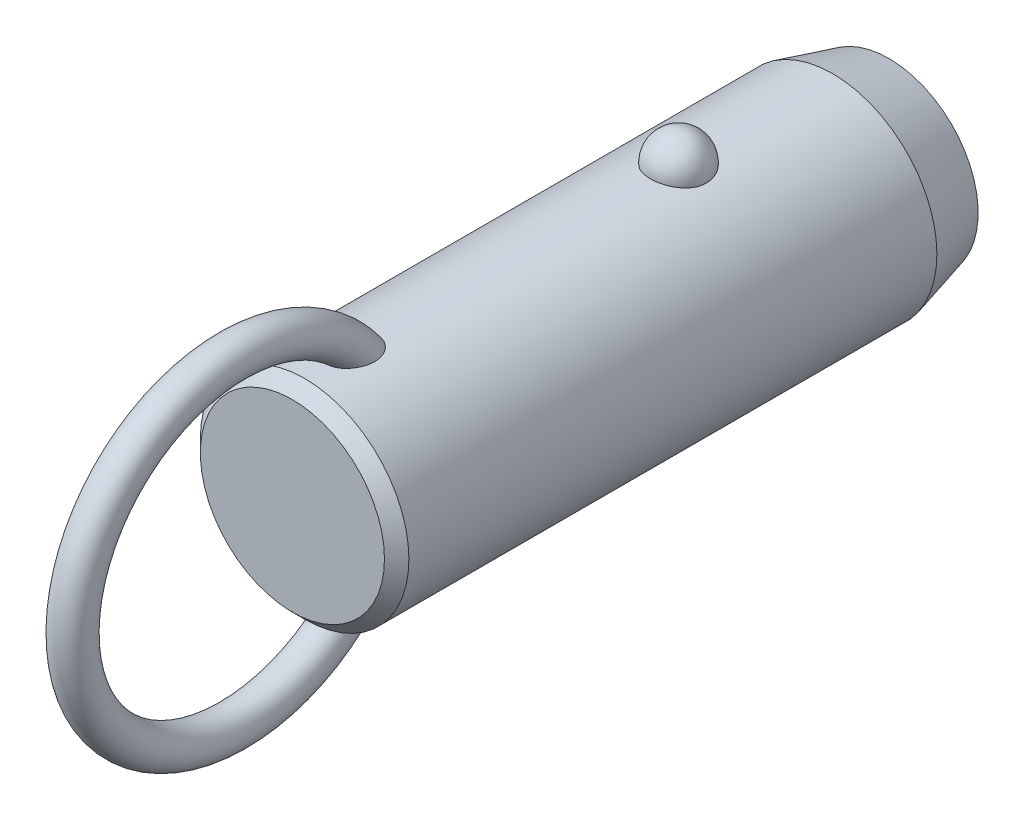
ISO-10303-21;
HEADER;
FILE_DESCRIPTION(('STEP AP214'),'2;1');
FILE_NAME('part.step','',(''),(''),'','','');
FILE_SCHEMA(('AUTOMOTIVE_DESIGN { 1 0 10303 214 1 1 1 1 }'));
ENDSEC;
DATA;
#1=APPLICATION_CONTEXT('core data for automotive mechanical design processes');
#2=APPLICATION_PROTOCOL_DEFINITION('international standard','automotive_design',2000,#1);
#3=PRODUCT_CONTEXT('',#1,'mechanical');
#4=PRODUCT('Part','Part','',(#3));
#5=PRODUCT_RELATED_PRODUCT_CATEGORY('part','',(#4));
#6=PRODUCT_DEFINITION_FORMATION('','',#4);
#7=PRODUCT_DEFINITION_CONTEXT('part definition',#1,'design');
#8=PRODUCT_DEFINITION('design','',#6,#7);
#9=PRODUCT_DEFINITION_SHAPE('','',#8);
#10=(LENGTH_UNIT() NAMED_UNIT(*) SI_UNIT(.MILLI.,.METRE.));
#11=(NAMED_UNIT(*) PLANE_ANGLE_UNIT() SI_UNIT($,.RADIAN.));
#12=(NAMED_UNIT(*) SI_UNIT($,.STERADIAN.) SOLID_ANGLE_UNIT());
#13=UNCERTAINTY_MEASURE_WITH_UNIT(LENGTH_MEASURE(1.E-05),#10,'distance_accuracy_value','');
#14=(GEOMETRIC_REPRESENTATION_CONTEXT(3) GLOBAL_UNCERTAINTY_ASSIGNED_CONTEXT((#13)) GLOBAL_UNIT_ASSIGNED_CONTEXT((#10,
#11,#12)) REPRESENTATION_CONTEXT('',''));
#15=CARTESIAN_POINT('',(0.,0.,0.));
#16=DIRECTION('',(0.,0.,1.));
#17=DIRECTION('',(1.,0.,0.));
#18=AXIS2_PLACEMENT_3D('',#15,#16,#17);
#19=CARTESIAN_POINT('',(0.,0.,25.4));
#20=DIRECTION('',(0.,0.,-1.));
#21=DIRECTION('',(-1.,0.,0.));
#22=AXIS2_PLACEMENT_3D('',#19,#20,#21);
#23=CYLINDRICAL_SURFACE('',#22,11.1);
#24=CARTESIAN_POINT('',(2.9724815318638,10.6945945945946,-3.00000000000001));
#25=CARTESIAN_POINT('',(2.9724783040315,10.6945972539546,-2.8322505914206));
#26=CARTESIAN_POINT('',(2.95876598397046,10.6984356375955,-2.66445972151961));
#27=CARTESIAN_POINT('',(2.90424529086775,10.7133624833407,-2.3336238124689));
#28=CARTESIAN_POINT('',(2.8634252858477,10.7244540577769,-2.17058084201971));
#29=CARTESIAN_POINT('',(2.75573657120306,10.7526272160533,-1.85396767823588));
#30=CARTESIAN_POINT('',(2.68887937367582,10.7697061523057,-1.70039333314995));
#31=CARTESIAN_POINT('',(2.53079696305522,10.8079438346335,-1.4069159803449));
#32=CARTESIAN_POINT('',(2.43957264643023,10.8291024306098,-1.26701246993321));
#33=CARTESIAN_POINT('',(2.23458150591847,10.8732541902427,-1.00409565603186));
#34=CARTESIAN_POINT('',(2.12071295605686,10.8962553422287,-0.88116297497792));
#35=CARTESIAN_POINT('',(1.87365402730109,10.9414421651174,-0.656352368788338));
#36=CARTESIAN_POINT('',(1.74046358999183,10.9636278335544,-0.554474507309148));
#37=CARTESIAN_POINT('',(1.45872188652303,11.0046495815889,-0.374872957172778));
#38=CARTESIAN_POINT('',(1.31021276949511,11.0234944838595,-0.297085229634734));
#39=CARTESIAN_POINT('',(1.00170030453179,11.0557957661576,-0.167529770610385));
#40=CARTESIAN_POINT('',(0.841698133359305,11.0692526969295,-0.115759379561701));
#41=CARTESIAN_POINT('',(0.51760779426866,11.0890932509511,-0.040392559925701));
#42=CARTESIAN_POINT('',(0.353633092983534,11.0955916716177,-0.0163383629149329));
#43=CARTESIAN_POINT('',(0.0238420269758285,11.1011989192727,0.0044517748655));
#44=CARTESIAN_POINT('',(-0.141974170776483,11.1003084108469,0.00119017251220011));
#45=CARTESIAN_POINT('',(-0.468405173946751,11.0912990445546,-0.0323233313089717));
#46=CARTESIAN_POINT('',(-0.629059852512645,11.0832767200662,-0.0622147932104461));
#47=CARTESIAN_POINT('',(-0.942937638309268,11.0609962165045,-0.147645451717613));
#48=CARTESIAN_POINT('',(-1.09616062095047,11.0467379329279,-0.20318507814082));
#49=CARTESIAN_POINT('',(-1.39181061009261,11.0134071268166,-0.338752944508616));
#50=CARTESIAN_POINT('',(-1.53417383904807,10.9943086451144,-0.418913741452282));
#51=CARTESIAN_POINT('',(-1.80342160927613,10.9533667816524,-0.601448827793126));
#52=CARTESIAN_POINT('',(-1.9303046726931,10.9315231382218,-0.703825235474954));
#53=CARTESIAN_POINT('',(-2.16747598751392,10.887005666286,-0.93009164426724));
#54=CARTESIAN_POINT('',(-2.27742774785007,10.8643239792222,-1.05433291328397));
#55=CARTESIAN_POINT('',(-2.47517316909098,10.8209886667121,-1.31966633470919));
#56=CARTESIAN_POINT('',(-2.56296538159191,10.8003351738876,-1.46075958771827));
#57=CARTESIAN_POINT('',(-2.71500300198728,10.7631304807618,-1.75753646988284));
#58=CARTESIAN_POINT('',(-2.77898901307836,10.7466250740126,-1.91335887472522));
#59=CARTESIAN_POINT('',(-2.88046189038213,10.7198747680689,-2.23391529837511));
#60=CARTESIAN_POINT('',(-2.91794947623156,10.709629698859,-2.3986490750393));
#61=CARTESIAN_POINT('',(-2.96537819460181,10.6965949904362,-2.73165170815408));
#62=CARTESIAN_POINT('',(-2.97542891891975,10.693775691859,-2.89990378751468));
#63=CARTESIAN_POINT('',(-2.96804271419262,10.6958279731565,-3.23575286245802));
#64=CARTESIAN_POINT('',(-2.95060646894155,10.7006993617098,-3.4033498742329));
#65=CARTESIAN_POINT('',(-2.88883358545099,10.71753912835,-3.73233906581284));
#66=CARTESIAN_POINT('',(-2.84462026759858,10.7294749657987,-3.89375610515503));
#67=CARTESIAN_POINT('',(-2.73050447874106,10.7590797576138,-4.20667949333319));
#68=CARTESIAN_POINT('',(-2.66060103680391,10.7767489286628,-4.35818546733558));
#69=CARTESIAN_POINT('',(-2.49642559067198,10.8159599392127,-4.64785421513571));
#70=CARTESIAN_POINT('',(-2.40203047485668,10.8375211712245,-4.78594458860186));
#71=CARTESIAN_POINT('',(-2.19143488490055,10.8820570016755,-5.04410382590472));
#72=CARTESIAN_POINT('',(-2.07523364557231,10.9050316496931,-5.16417205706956));
#73=CARTESIAN_POINT('',(-1.82361254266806,10.9499219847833,-5.3833483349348));
#74=CARTESIAN_POINT('',(-1.68812945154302,10.9718338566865,-5.48238464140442));
#75=CARTESIAN_POINT('',(-1.40191298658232,11.0120611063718,-5.65618873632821));
#76=CARTESIAN_POINT('',(-1.25118062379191,11.0303767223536,-5.73095813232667));
#77=CARTESIAN_POINT('',(-0.940570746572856,11.0611653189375,-5.85334725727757));
#78=CARTESIAN_POINT('',(-0.780821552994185,11.0737044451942,-5.90127578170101));
#79=CARTESIAN_POINT('',(-0.455204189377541,11.0918598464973,-5.9699297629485));
#80=CARTESIAN_POINT('',(-0.289336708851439,11.0974768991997,-5.99065827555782));
#81=CARTESIAN_POINT('',(0.0406846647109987,11.1011307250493,-6.00418773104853));
#82=CARTESIAN_POINT('',(0.204817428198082,11.099299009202,-5.99747318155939));
#83=CARTESIAN_POINT('',(0.5295530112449,11.088551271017,-5.95740317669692));
#84=CARTESIAN_POINT('',(0.690155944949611,11.0796354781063,-5.92404858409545));
#85=CARTESIAN_POINT('',(1.0027760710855,11.0557204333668,-5.83180084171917));
#86=CARTESIAN_POINT('',(1.15482001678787,11.0407414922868,-5.7729929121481));
#87=CARTESIAN_POINT('',(1.44678373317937,11.0062913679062,-5.63147366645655));
#88=CARTESIAN_POINT('',(1.58670279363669,10.9868199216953,-5.54876095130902));
#89=CARTESIAN_POINT('',(1.8527023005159,10.9451315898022,-5.36027644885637));
#90=CARTESIAN_POINT('',(1.97855158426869,10.9228788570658,-5.25418644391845));
#91=CARTESIAN_POINT('',(2.21080872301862,10.8782509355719,-5.02251354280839));
#92=CARTESIAN_POINT('',(2.31721312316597,10.8558757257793,-4.89692718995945));
#93=CARTESIAN_POINT('',(2.50945517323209,10.8130715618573,-4.62745408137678));
#94=CARTESIAN_POINT('',(2.59493284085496,10.7926798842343,-4.48330448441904));
#95=CARTESIAN_POINT('',(2.740862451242,10.7565495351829,-4.18236358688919));
#96=CARTESIAN_POINT('',(2.80132490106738,10.7408089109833,-4.02557762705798));
#97=CARTESIAN_POINT('',(2.88959070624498,10.7173718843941,-3.72475308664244));
#98=CARTESIAN_POINT('',(2.92062102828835,10.7088950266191,-3.58171216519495));
#99=CARTESIAN_POINT('',(2.96206765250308,10.6975052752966,-3.29245795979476));
#100=CARTESIAN_POINT('',(2.97248434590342,10.6945922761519,-3.14624473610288));
#101=CARTESIAN_POINT('',(2.9724815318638,10.6945945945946,-3.00000000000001));
#102=B_SPLINE_CURVE_WITH_KNOTS('',3,(#24,#25,#26,#27,#28,#29,#30,#31,#32,#33,#34,#35,#36,#37,
#38,#39,#40,#41,#42,#43,#44,#45,#46,#47,#48,#49,#50,#51,#52,#53,#54,#55,#56,#57,#58,#59,#60,#61,
#62,#63,#64,#65,#66,#67,#68,#69,#70,#71,#72,#73,#74,#75,#76,#77,#78,#79,#80,#81,#82,#83,#84,#85,
#86,#87,#88,#89,#90,#91,#92,#93,#94,#95,#96,#97,#98,#99,#100,#101),.UNSPECIFIED.,.T.,.F.,(4,2,2,
2,2,2,2,2,2,2,2,2,2,2,2,2,2,2,2,2,2,2,2,2,2,2,2,2,2,2,2,2,2,2,2,2,2,2,4),(0.,0.502722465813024,
1.00566079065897,1.5083769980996,2.01107471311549,2.51608392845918,3.02109467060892,
3.52475118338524,4.02835620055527,4.52351860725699,5.0186364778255,5.50715297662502,
5.99567766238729,6.48688002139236,6.97812923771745,7.47814366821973,7.97819077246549,
8.48353712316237,8.98886974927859,9.49218093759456,9.99547960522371,10.4964777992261,
10.997494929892,11.5010810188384,12.0046847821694,12.5099796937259,13.0152411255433,
13.5145635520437,14.0138298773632,14.5043200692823,14.9947943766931,15.4836390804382,
15.9725123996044,16.4685040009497,16.9645836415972,17.4686765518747,17.972557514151,
18.410841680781,18.849117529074),.UNSPECIFIED.);
#103=CARTESIAN_POINT('',(2.9724815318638,10.6945945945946,-3.00000000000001));
#104=VERTEX_POINT('',#103);
#105=EDGE_CURVE('E41',#104,#104,#102,.T.);
#106=ORIENTED_EDGE('',*,*,#105,.T.);
#107=EDGE_LOOP('',(#106));
#108=FACE_BOUND('',#107,.T.);
#109=CARTESIAN_POINT('',(0.,0.,36.8));
#110=DIRECTION('',(0.,0.,1.));
#111=DIRECTION('',(1.,0.,0.));
#112=AXIS2_PLACEMENT_3D('',#109,#110,#111);
#113=CIRCLE('',#112,11.1);
#114=CARTESIAN_POINT('',(11.1,0.,36.8));
#115=VERTEX_POINT('',#114);
#116=EDGE_CURVE('E10',#115,#115,#113,.F.);
#117=ORIENTED_EDGE('',*,*,#116,.T.);
#118=EDGE_LOOP('',(#117));
#119=FACE_BOUND('',#118,.T.);
#120=CARTESIAN_POINT('',(-0.564520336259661,-11.0856356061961,29.0578154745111));
#121=CARTESIAN_POINT('',(-0.667202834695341,-11.0804062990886,29.0912839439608));
#122=CARTESIAN_POINT('',(-0.766875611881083,-11.0738877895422,29.1338357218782));
#123=CARTESIAN_POINT('',(-0.957284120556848,-11.0590576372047,29.2354190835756));
#124=CARTESIAN_POINT('',(-1.04801616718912,-11.0507452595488,29.2944574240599));
#125=CARTESIAN_POINT('',(-1.21800952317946,-11.0333016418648,29.4265293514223));
#126=CARTESIAN_POINT('',(-1.29730805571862,-11.0241732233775,29.4995156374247));
#127=CARTESIAN_POINT('',(-1.44337665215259,-11.0060026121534,29.6570374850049));
#128=CARTESIAN_POINT('',(-1.51014622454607,-10.9969604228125,29.7415734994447));
#129=CARTESIAN_POINT('',(-1.63454620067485,-10.9791841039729,29.9255213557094));
#130=CARTESIAN_POINT('',(-1.69127003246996,-10.9705107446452,30.0255493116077));
#131=CARTESIAN_POINT('',(-1.78980785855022,-10.9548648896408,30.2327902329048));
#132=CARTESIAN_POINT('',(-1.83161214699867,-10.9478935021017,30.3400078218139));
#133=CARTESIAN_POINT('',(-1.91557028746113,-10.9335803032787,30.6054080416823));
#134=CARTESIAN_POINT('',(-1.95040620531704,-10.9273269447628,30.7659806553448));
#135=CARTESIAN_POINT('',(-1.99388326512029,-10.9194709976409,31.0906977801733));
#136=CARTESIAN_POINT('',(-2.00248051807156,-10.9178762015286,31.2548478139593));
#137=CARTESIAN_POINT('',(-1.99551615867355,-10.9191578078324,31.6246504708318));
#138=CARTESIAN_POINT('',(-1.9732206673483,-10.9232807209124,31.8301911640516));
#139=CARTESIAN_POINT('',(-1.9152976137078,-10.9335244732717,32.133595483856));
#140=CARTESIAN_POINT('',(-1.89184575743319,-10.9376266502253,32.2340883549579));
#141=CARTESIAN_POINT('',(-1.83700674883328,-10.9469720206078,32.432855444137));
#142=CARTESIAN_POINT('',(-1.80562070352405,-10.9522150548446,32.5311299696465));
#143=CARTESIAN_POINT('',(-1.73463055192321,-10.9636837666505,32.7259148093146));
#144=CARTESIAN_POINT('',(-1.69493416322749,-10.9699202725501,32.8223907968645));
#145=CARTESIAN_POINT('',(-1.60745141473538,-10.9830806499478,33.0116262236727));
#146=CARTESIAN_POINT('',(-1.55966150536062,-10.9900048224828,33.1043840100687));
#147=CARTESIAN_POINT('',(-1.45591812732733,-11.0042280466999,33.2846907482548));
#148=CARTESIAN_POINT('',(-1.40000013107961,-11.0115253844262,33.3722601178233));
#149=CARTESIAN_POINT('',(-1.2793747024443,-11.0261911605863,33.541029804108));
#150=CARTESIAN_POINT('',(-1.21467835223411,-11.0335594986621,33.6222379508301));
#151=CARTESIAN_POINT('',(-1.08218150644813,-11.0473027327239,33.7690010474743));
#152=CARTESIAN_POINT('',(-1.0152263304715,-11.0537063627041,33.8353092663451));
#153=CARTESIAN_POINT('',(-0.872952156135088,-11.065850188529,33.958378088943));
#154=CARTESIAN_POINT('',(-0.797642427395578,-11.0715911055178,34.0151491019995));
#155=CARTESIAN_POINT('',(-0.651396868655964,-11.081071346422,34.1075155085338));
#156=CARTESIAN_POINT('',(-0.581712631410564,-11.0849841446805,34.1450491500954));
#157=CARTESIAN_POINT('',(-0.437066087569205,-11.0916271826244,34.2082594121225));
#158=CARTESIAN_POINT('',(-0.362109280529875,-11.0943586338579,34.2339481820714));
#159=CARTESIAN_POINT('',(-0.207828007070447,-11.0983242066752,34.271117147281));
#160=CARTESIAN_POINT('',(-0.1284677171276,-11.0995432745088,34.2824545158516));
#161=CARTESIAN_POINT('',(0.0309101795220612,-11.1002423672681,34.2889658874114));
#162=CARTESIAN_POINT('',(0.11092739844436,-11.0997233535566,34.2841488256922));
#163=CARTESIAN_POINT('',(0.256406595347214,-11.097240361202,34.2609599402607));
#164=CARTESIAN_POINT('',(0.322235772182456,-11.0955074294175,34.2447543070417));
#165=CARTESIAN_POINT('',(0.45063593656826,-11.0910350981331,34.2026008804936));
#166=CARTESIAN_POINT('',(0.513205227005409,-11.0882951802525,34.1766480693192));
#167=CARTESIAN_POINT('',(0.662626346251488,-11.0805620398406,34.1026073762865));
#168=CARTESIAN_POINT('',(0.747127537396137,-11.0751144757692,34.0498452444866));
#169=CARTESIAN_POINT('',(0.906756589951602,-11.0631932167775,33.9317206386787));
#170=CARTESIAN_POINT('',(0.98185949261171,-11.0567168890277,33.8663257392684));
#171=CARTESIAN_POINT('',(1.1071220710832,-11.0447856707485,33.7422633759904));
#172=CARTESIAN_POINT('',(1.15909566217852,-11.0394280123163,33.6853831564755));
#173=CARTESIAN_POINT('',(1.25791923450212,-11.0286040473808,33.5673271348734));
#174=CARTESIAN_POINT('',(1.30476642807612,-11.0231376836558,33.5061490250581));
#175=CARTESIAN_POINT('',(1.43818612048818,-11.0068027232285,33.317305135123));
#176=CARTESIAN_POINT('',(1.51751767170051,-10.9960104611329,33.1844531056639));
#177=CARTESIAN_POINT('',(1.63597546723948,-10.9788847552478,32.9531371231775));
#178=CARTESIAN_POINT('',(1.67988876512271,-10.9722190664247,32.8570530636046));
#179=CARTESIAN_POINT('',(1.75953241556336,-10.9597298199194,32.6614311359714));
#180=CARTESIAN_POINT('',(1.79525967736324,-10.9539065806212,32.5618919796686));
#181=CARTESIAN_POINT('',(1.85844731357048,-10.9433632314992,32.3602111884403));
#182=CARTESIAN_POINT('',(1.88591073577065,-10.9386427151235,32.2580705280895));
#183=CARTESIAN_POINT('',(1.93234324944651,-10.9305350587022,32.0518191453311));
#184=CARTESIAN_POINT('',(1.95131065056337,-10.9271481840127,31.9477080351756));
#185=CARTESIAN_POINT('',(1.99040203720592,-10.9201183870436,31.6654588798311));
#186=CARTESIAN_POINT('',(2.00221217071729,-10.9179256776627,31.4860370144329));
#187=CARTESIAN_POINT('',(1.99711676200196,-10.9188636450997,31.1277133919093));
#188=CARTESIAN_POINT('',(1.98026150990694,-10.9219849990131,30.948811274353));
#189=CARTESIAN_POINT('',(1.92151657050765,-10.9324473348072,30.6364514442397));
#190=CARTESIAN_POINT('',(1.88605081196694,-10.9386915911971,30.5017594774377));
#191=CARTESIAN_POINT('',(1.79393020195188,-10.9541780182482,30.2399669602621));
#192=CARTESIAN_POINT('',(1.73729868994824,-10.9634168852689,30.1128582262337));
#193=CARTESIAN_POINT('',(1.61237037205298,-10.9824218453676,29.8894184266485));
#194=CARTESIAN_POINT('',(1.54715374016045,-10.9918945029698,29.7913455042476));
#195=CARTESIAN_POINT('',(1.40127026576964,-11.0114415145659,29.6074341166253));
#196=CARTESIAN_POINT('',(1.32060742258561,-11.0215157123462,29.5215924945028));
#197=CARTESIAN_POINT('',(1.14474787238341,-11.041168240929,29.3651630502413));
#198=CARTESIAN_POINT('',(1.04947805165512,-11.0507437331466,29.2946565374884));
#199=CARTESIAN_POINT('',(0.84727806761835,-11.0680789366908,29.172640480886));
#200=CARTESIAN_POINT('',(0.74035174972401,-11.0758392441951,29.1211246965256));
#201=CARTESIAN_POINT('',(0.529289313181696,-11.0878275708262,29.0434852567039));
#202=CARTESIAN_POINT('',(0.425895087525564,-11.0923259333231,29.015377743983));
#203=CARTESIAN_POINT('',(0.215723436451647,-11.0984001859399,28.9777038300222));
#204=CARTESIAN_POINT('',(0.108947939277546,-11.0999777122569,28.9681270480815));
#205=CARTESIAN_POINT('',(-0.0938962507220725,-11.1000196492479,28.9678773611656));
#206=CARTESIAN_POINT('',(-0.189967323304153,-11.0987797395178,28.9754089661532));
#207=CARTESIAN_POINT('',(-0.379657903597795,-11.0939111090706,29.0055079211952));
#208=CARTESIAN_POINT('',(-0.473277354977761,-11.0902823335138,29.0280756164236));
#209=CARTESIAN_POINT('',(-0.564520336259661,-11.0856356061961,29.0578154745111));
#210=B_SPLINE_CURVE_WITH_KNOTS('',3,(#120,#121,#122,#123,#124,#125,#126,#127,#128,#129,#130,
#131,#132,#133,#134,#135,#136,#137,#138,#139,#140,#141,#142,#143,#144,#145,#146,#147,#148,#149,
#150,#151,#152,#153,#154,#155,#156,#157,#158,#159,#160,#161,#162,#163,#164,#165,#166,#167,#168,
#169,#170,#171,#172,#173,#174,#175,#176,#177,#178,#179,#180,#181,#182,#183,#184,#185,#186,#187,
#188,#189,#190,#191,#192,#193,#194,#195,#196,#197,#198,#199,#200,#201,#202,#203,#204,#205,#206,
#207,#208,#209),.UNSPECIFIED.,.T.,.F.,(4,2,2,2,2,2,2,2,2,2,2,2,2,2,2,2,2,2,2,2,2,2,2,2,2,2,2,2,
2,2,2,2,2,2,2,2,2,2,2,2,2,2,2,2,4),(0.,0.323999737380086,0.648132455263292,0.971184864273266,
1.29424994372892,1.6388623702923,1.98369857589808,2.47426059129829,2.96564271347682,
3.58257396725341,3.89215258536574,4.20168803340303,4.51486273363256,4.82817514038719,
5.14015911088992,5.45175282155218,5.73442856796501,6.0167937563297,6.25364580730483,
6.49025437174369,6.72919963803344,6.96801276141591,7.17061258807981,7.37331685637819,
7.67094989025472,7.96935728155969,8.20075067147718,8.43226927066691,8.89581623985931,
9.2130653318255,9.53043400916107,9.84768549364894,10.1650000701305,10.70229304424,
11.2386443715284,11.6553390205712,12.0715755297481,12.4245637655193,12.7774607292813,
13.1321855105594,13.4867936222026,13.8068771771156,14.1267813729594,14.4146787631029,
14.7025827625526),.UNSPECIFIED.);
#211=CARTESIAN_POINT('',(-0.564520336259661,-11.0856356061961,29.0578154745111));
#212=VERTEX_POINT('',#211);
#213=EDGE_CURVE('E59',#212,#212,#210,.T.);
#214=ORIENTED_EDGE('',*,*,#213,.T.);
#215=EDGE_LOOP('',(#214));
#216=FACE_BOUND('',#215,.T.);
#217=CARTESIAN_POINT('',(-0.564520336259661,11.0856356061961,29.0578154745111));
#218=CARTESIAN_POINT('',(-0.468542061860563,11.0905203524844,29.0265456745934));
#219=CARTESIAN_POINT('',(-0.369793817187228,11.0942886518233,29.0031576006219));
#220=CARTESIAN_POINT('',(-0.16955579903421,11.0991586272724,28.9730858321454));
#221=CARTESIAN_POINT('',(-0.0680604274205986,11.1002543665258,28.9664393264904));
#222=CARTESIAN_POINT('',(0.134549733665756,11.099646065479,28.9701579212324));
#223=CARTESIAN_POINT('',(0.235664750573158,11.0979441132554,28.9805103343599));
#224=CARTESIAN_POINT('',(0.434632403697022,11.0919342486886,29.0178318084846));
#225=CARTESIAN_POINT('',(0.532486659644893,11.0876276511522,29.0447924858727));
#226=CARTESIAN_POINT('',(0.72244585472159,11.0768742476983,29.1144096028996));
#227=CARTESIAN_POINT('',(0.814543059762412,11.0704246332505,29.1570866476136));
#228=CARTESIAN_POINT('',(0.990565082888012,11.0560659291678,29.2566487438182));
#229=CARTESIAN_POINT('',(1.07448844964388,11.048156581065,29.3135363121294));
#230=CARTESIAN_POINT('',(1.23562672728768,11.0313221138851,29.4422106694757));
#231=CARTESIAN_POINT('',(1.31242684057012,11.0223686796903,29.5145117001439));
#232=CARTESIAN_POINT('',(1.45398030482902,11.0045918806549,29.6700425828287));
#233=CARTESIAN_POINT('',(1.51873073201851,10.9957685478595,29.7532750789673));
#234=CARTESIAN_POINT('',(1.64107232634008,10.9782087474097,29.9363842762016));
#235=CARTESIAN_POINT('',(1.6974317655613,10.9695572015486,30.0370893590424));
#236=CARTESIAN_POINT('',(1.79515063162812,10.9539887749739,30.2456264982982));
#237=CARTESIAN_POINT('',(1.83649966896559,10.9470730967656,30.3534634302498));
#238=CARTESIAN_POINT('',(1.91931148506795,10.9329211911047,30.6203995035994));
#239=CARTESIAN_POINT('',(1.9534010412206,10.9267904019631,30.7818612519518));
#240=CARTESIAN_POINT('',(1.99526195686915,10.9192174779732,31.1082163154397));
#241=CARTESIAN_POINT('',(2.00298989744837,10.9177830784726,31.2731148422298));
#242=CARTESIAN_POINT('',(1.99396251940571,10.9194420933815,31.6441006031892));
#243=CARTESIAN_POINT('',(1.97050829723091,10.923774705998,31.8500387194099));
#244=CARTESIAN_POINT('',(1.91079643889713,10.9343131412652,32.1539019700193));
#245=CARTESIAN_POINT('',(1.8867370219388,10.9385106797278,32.2545296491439));
#246=CARTESIAN_POINT('',(1.83065508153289,10.9480376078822,32.4535107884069));
#247=CARTESIAN_POINT('',(1.79863369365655,10.9533668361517,32.551864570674));
#248=CARTESIAN_POINT('',(1.72633365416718,10.9649954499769,32.746720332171));
#249=CARTESIAN_POINT('',(1.68596409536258,10.9713053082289,32.8431879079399));
#250=CARTESIAN_POINT('',(1.59707998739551,10.9845964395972,33.0323233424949));
#251=CARTESIAN_POINT('',(1.54856169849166,10.9915780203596,33.1249894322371));
#252=CARTESIAN_POINT('',(1.4433016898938,11.0058935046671,33.3049752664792));
#253=CARTESIAN_POINT('',(1.38659749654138,11.0132257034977,33.392316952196));
#254=CARTESIAN_POINT('',(1.26431158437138,11.0279330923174,33.5604563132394));
#255=CARTESIAN_POINT('',(1.198741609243,11.0353082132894,33.6412624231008));
#256=CARTESIAN_POINT('',(1.06542088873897,11.048931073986,33.7859856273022));
#257=CARTESIAN_POINT('',(0.998640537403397,11.0552153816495,33.850784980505));
#258=CARTESIAN_POINT('',(0.856896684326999,11.0671032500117,33.9708462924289));
#259=CARTESIAN_POINT('',(0.781942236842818,11.0727075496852,34.0261186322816));
#260=CARTESIAN_POINT('',(0.636276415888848,11.081949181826,34.1159721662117));
#261=CARTESIAN_POINT('',(0.566755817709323,11.0857572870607,34.1524410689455));
#262=CARTESIAN_POINT('',(0.422602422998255,11.0921860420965,34.2135333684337));
#263=CARTESIAN_POINT('',(0.347974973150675,11.0948079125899,34.2381689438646));
#264=CARTESIAN_POINT('',(0.194593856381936,11.0985608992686,34.2733233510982));
#265=CARTESIAN_POINT('',(0.115807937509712,11.0996777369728,34.2837069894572));
#266=CARTESIAN_POINT('',(-0.0422499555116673,11.1002003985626,34.2885747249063));
#267=CARTESIAN_POINT('',(-0.121521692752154,11.09960699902,34.283066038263));
#268=CARTESIAN_POINT('',(-0.266046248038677,11.0970123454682,34.2588271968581));
#269=CARTESIAN_POINT('',(-0.3316616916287,11.0952283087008,34.2421356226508));
#270=CARTESIAN_POINT('',(-0.459588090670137,11.0906663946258,34.1991117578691));
#271=CARTESIAN_POINT('',(-0.521897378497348,11.0878880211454,34.172774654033));
#272=CARTESIAN_POINT('',(-0.67144642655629,11.0800342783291,34.0975130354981));
#273=CARTESIAN_POINT('',(-0.756250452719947,11.0744969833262,34.043818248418));
#274=CARTESIAN_POINT('',(-0.916349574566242,11.0624045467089,33.9238029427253));
#275=CARTESIAN_POINT('',(-0.991618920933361,11.0558467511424,33.8574493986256));
#276=CARTESIAN_POINT('',(-1.11713140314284,11.0437783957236,33.7316335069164));
#277=CARTESIAN_POINT('',(-1.16920539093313,11.0383619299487,33.6739524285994));
#278=CARTESIAN_POINT('',(-1.26817476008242,11.02743010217,33.5542809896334));
#279=CARTESIAN_POINT('',(-1.315067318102,11.0219146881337,33.4922883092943));
#280=CARTESIAN_POINT('',(-1.40399813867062,11.0109399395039,33.3647843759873));
#281=CARTESIAN_POINT('',(-1.44602864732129,11.0054807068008,33.2992677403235));
#282=CARTESIAN_POINT('',(-1.52538779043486,10.9947621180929,33.1654223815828));
#283=CARTESIAN_POINT('',(-1.56271516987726,10.9895028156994,33.0970929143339));
#284=CARTESIAN_POINT('',(-1.64537943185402,10.9774790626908,32.9332101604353));
#285=CARTESIAN_POINT('',(-1.68879497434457,10.9708503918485,32.8366735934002));
#286=CARTESIAN_POINT('',(-1.76740738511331,10.9584602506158,32.6402369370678));
#287=CARTESIAN_POINT('',(-1.80260120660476,10.95269910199,32.5403356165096));
#288=CARTESIAN_POINT('',(-1.86468657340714,10.9423003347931,32.3379663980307));
#289=CARTESIAN_POINT('',(-1.8915816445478,10.9376622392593,32.2354996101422));
#290=CARTESIAN_POINT('',(-1.93682458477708,10.9297405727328,32.0286429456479));
#291=CARTESIAN_POINT('',(-1.95517082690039,10.9264572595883,31.9242527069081));
#292=CARTESIAN_POINT('',(-1.99232562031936,10.9197647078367,31.64262876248));
#293=CARTESIAN_POINT('',(-2.00294603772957,10.9177914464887,31.4641857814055));
#294=CARTESIAN_POINT('',(-1.99566675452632,10.9191290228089,31.1079962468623));
#295=CARTESIAN_POINT('',(-1.97781651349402,10.9224306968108,30.9302490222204));
#296=CARTESIAN_POINT('',(-1.91747214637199,10.9331592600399,30.6197921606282));
#297=CARTESIAN_POINT('',(-1.88131022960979,10.9395108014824,30.485825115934));
#298=CARTESIAN_POINT('',(-1.78790380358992,10.9551659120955,30.2255975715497));
#299=CARTESIAN_POINT('',(-1.73068309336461,10.9644661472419,30.0993285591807));
#300=CARTESIAN_POINT('',(-1.60475573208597,10.9835398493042,29.8774156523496));
#301=CARTESIAN_POINT('',(-1.53908879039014,10.9930297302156,29.7800265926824));
#302=CARTESIAN_POINT('',(-1.39238608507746,11.0125708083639,29.5975250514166));
#303=CARTESIAN_POINT('',(-1.31135150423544,11.0226219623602,29.5124116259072));
#304=CARTESIAN_POINT('',(-1.14382035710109,11.0411991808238,29.3652994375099));
#305=CARTESIAN_POINT('',(-1.0585850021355,11.0497792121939,29.3018693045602));
#306=CARTESIAN_POINT('',(-0.878723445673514,11.0655285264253,29.1902505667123));
#307=CARTESIAN_POINT('',(-0.78412346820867,11.0727015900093,29.1420208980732));
#308=CARTESIAN_POINT('',(-0.646163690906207,11.0812501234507,29.086023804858));
#309=CARTESIAN_POINT('',(-0.60559567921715,11.0835451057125,29.0711978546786));
#310=CARTESIAN_POINT('',(-0.564520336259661,11.0856356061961,29.0578154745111));
#311=B_SPLINE_CURVE_WITH_KNOTS('',3,(#217,#218,#219,#220,#221,#222,#223,#224,#225,#226,#227,
#228,#229,#230,#231,#232,#233,#234,#235,#236,#237,#238,#239,#240,#241,#242,#243,#244,#245,#246,
#247,#248,#249,#250,#251,#252,#253,#254,#255,#256,#257,#258,#259,#260,#261,#262,#263,#264,#265,
#266,#267,#268,#269,#270,#271,#272,#273,#274,#275,#276,#277,#278,#279,#280,#281,#282,#283,#284,
#285,#286,#287,#288,#289,#290,#291,#292,#293,#294,#295,#296,#297,#298,#299,#300,#301,#302,#303,
#304,#305,#306,#307,#308,#309,#310),.UNSPECIFIED.,.T.,.F.,(4,2,2,2,2,2,2,2,2,2,2,2,2,2,2,2,2,2,
2,2,2,2,2,2,2,2,2,2,2,2,2,2,2,2,2,2,2,2,2,2,2,2,2,2,2,2,4),(0.,0.303061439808,0.606795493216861,
0.910302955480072,1.21365733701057,1.51741085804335,1.82121821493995,2.13745205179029,
2.45376252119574,2.799586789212,3.14564996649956,3.63832391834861,4.13180893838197,
4.75031912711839,5.06071926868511,5.37107516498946,5.68500772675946,5.99908475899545,
6.31176519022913,6.62403542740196,6.90315673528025,7.18197194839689,7.41687778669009,
7.65154134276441,7.88841587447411,8.12518286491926,8.32752842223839,8.5299750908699,
8.82986421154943,9.13054668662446,9.36393502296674,9.59744991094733,9.83133221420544,
10.0652767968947,10.383032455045,10.7009056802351,11.0186436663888,11.3364420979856,
11.8705925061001,12.4038159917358,12.8189662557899,13.2336487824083,13.5857049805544,
13.9377340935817,14.2561354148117,14.5736690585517,14.7033687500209),.UNSPECIFIED.);
#312=CARTESIAN_POINT('',(-0.564520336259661,11.0856356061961,29.0578154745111));
#313=VERTEX_POINT('',#312);
#314=EDGE_CURVE('E67',#313,#313,#311,.T.);
#315=ORIENTED_EDGE('',*,*,#314,.T.);
#316=EDGE_LOOP('',(#315));
#317=FACE_BOUND('',#316,.T.);
#318=CARTESIAN_POINT('',(0.,0.,-19.3999999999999));
#319=DIRECTION('',(0.,0.,-1.));
#320=DIRECTION('',(-1.,0.,0.));
#321=AXIS2_PLACEMENT_3D('',#318,#319,#320);
#322=CIRCLE('',#321,11.1);
#323=CARTESIAN_POINT('',(-11.1,0.,-19.3999999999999));
#324=VERTEX_POINT('',#323);
#325=EDGE_CURVE('E56',#324,#324,#322,.F.);
#326=ORIENTED_EDGE('',*,*,#325,.T.);
#327=EDGE_LOOP('',(#326));
#328=FACE_BOUND('',#327,.T.);
#329=ADVANCED_FACE('F37',(#108,#119,#216,#317,#328),#23,.T.);
#330=CARTESIAN_POINT('',(0.,0.,-25.4));
#331=DIRECTION('',(0.,0.,-1.));
#332=DIRECTION('',(-1.,0.,0.));
#333=AXIS2_PLACEMENT_3D('',#330,#331,#332);
#334=PLANE('',#333);
#335=CARTESIAN_POINT('',(0.,0.,-25.4));
#336=DIRECTION('',(0.,0.,-1.));
#337=DIRECTION('',(-1.,0.,0.));
#338=AXIS2_PLACEMENT_3D('',#335,#336,#337);
#339=CIRCLE('',#338,9.49230484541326);
#340=CARTESIAN_POINT('',(-9.49230484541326,0.,-25.4));
#341=VERTEX_POINT('',#340);
#342=EDGE_CURVE('E66',#341,#341,#339,.T.);
#343=ORIENTED_EDGE('',*,*,#342,.T.);
#344=EDGE_LOOP('',(#343));
#345=FACE_BOUND('',#344,.T.);
#346=ADVANCED_FACE('F85',(#345),#334,.T.);
#347=CARTESIAN_POINT('',(0.,0.,-25.4));
#348=DIRECTION('',(0.,0.,1.));
#349=DIRECTION('',(1.,0.,0.));
#350=AXIS2_PLACEMENT_3D('',#347,#348,#349);
#351=CONICAL_SURFACE('',#350,9.49230484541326,0.261799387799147);
#352=ORIENTED_EDGE('',*,*,#325,.F.);
#353=EDGE_LOOP('',(#352));
#354=FACE_BOUND('',#353,.T.);
#355=ORIENTED_EDGE('',*,*,#342,.F.);
#356=EDGE_LOOP('',(#355));
#357=FACE_BOUND('',#356,.T.);
#358=ADVANCED_FACE('F83',(#354,#357),#351,.T.);
#359=CARTESIAN_POINT('',(0.,0.,38.1));
#360=DIRECTION('',(0.,0.,1.));
#361=DIRECTION('',(1.,0.,0.));
#362=AXIS2_PLACEMENT_3D('',#359,#360,#361);
#363=PLANE('',#362);
#364=CARTESIAN_POINT('',(0.,0.,38.1));
#365=DIRECTION('',(0.,0.,1.));
#366=DIRECTION('',(1.,0.,0.));
#367=AXIS2_PLACEMENT_3D('',#364,#365,#366);
#368=CIRCLE('',#367,9.80000000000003);
#369=CARTESIAN_POINT('',(9.80000000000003,0.,38.1));
#370=VERTEX_POINT('',#369);
#371=EDGE_CURVE('E50',#370,#370,#368,.T.);
#372=ORIENTED_EDGE('',*,*,#371,.T.);
#373=EDGE_LOOP('',(#372));
#374=FACE_BOUND('',#373,.T.);
#375=ADVANCED_FACE('F77',(#374),#363,.T.);
#376=CARTESIAN_POINT('',(0.,0.,44.45));
#377=DIRECTION('',(1.,0.,0.));
#378=DIRECTION('',(0.,0.,-1.));
#379=AXIS2_PLACEMENT_3D('',#376,#377,#378);
#380=TOROIDAL_SURFACE('',#379,17.05,2.);
#381=ORIENTED_EDGE('',*,*,#314,.F.);
#382=EDGE_LOOP('',(#381));
#383=FACE_BOUND('',#382,.T.);
#384=ORIENTED_EDGE('',*,*,#213,.F.);
#385=EDGE_LOOP('',(#384));
#386=FACE_BOUND('',#385,.T.);
#387=ADVANCED_FACE('F73',(#383,#386),#380,.T.);
#388=CARTESIAN_POINT('',(0.,0.,38.1));
#389=DIRECTION('',(0.,0.,-1.));
#390=DIRECTION('',(-1.,0.,0.));
#391=AXIS2_PLACEMENT_3D('',#388,#389,#390);
#392=CONICAL_SURFACE('',#391,9.80000000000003,0.785398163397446);
#393=ORIENTED_EDGE('',*,*,#116,.F.);
#394=EDGE_LOOP('',(#393));
#395=FACE_BOUND('',#394,.T.);
#396=ORIENTED_EDGE('',*,*,#371,.F.);
#397=EDGE_LOOP('',(#396));
#398=FACE_BOUND('',#397,.T.);
#399=ADVANCED_FACE('F39',(#395,#398),#392,.T.);
#400=CARTESIAN_POINT('',(0.,11.1,-3.00000000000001));
#401=DIRECTION('',(0.,1.,0.));
#402=DIRECTION('',(0.,0.,-1.));
#403=AXIS2_PLACEMENT_3D('',#400,#401,#402);
#404=SPHERICAL_SURFACE('',#403,3.);
#405=ORIENTED_EDGE('',*,*,#105,.F.);
#406=EDGE_LOOP('',(#405));
#407=FACE_BOUND('',#406,.T.);
#408=ADVANCED_FACE('F79',(#407),#404,.T.);
#409=CLOSED_SHELL('',(#329,#346,#358,#375,#387,#399,#408));
#410=MANIFOLD_SOLID_BREP('B2',#409);
#411=ADVANCED_BREP_SHAPE_REPRESENTATION('',(#18,#410),#14);
#412=SHAPE_DEFINITION_REPRESENTATION(#9,#411);
ENDSEC;
END-ISO-10303-21;
